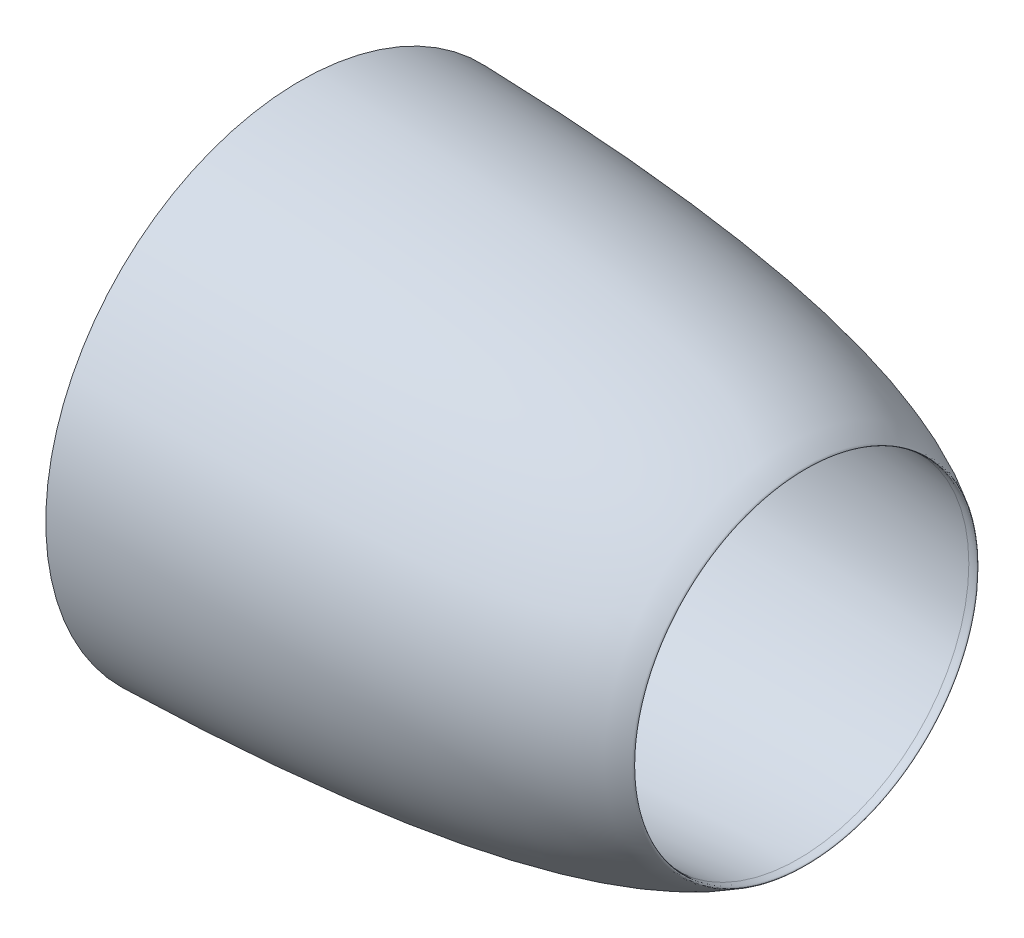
ISO-10303-21;
HEADER;
FILE_DESCRIPTION(('STEP AP214'),'2;1');
FILE_NAME('part.step','',(''),(''),'','','');
FILE_SCHEMA(('AUTOMOTIVE_DESIGN { 1 0 10303 214 1 1 1 1 }'));
ENDSEC;
DATA;
#1=APPLICATION_CONTEXT('core data for automotive mechanical design processes');
#2=APPLICATION_PROTOCOL_DEFINITION('international standard','automotive_design',2000,#1);
#3=PRODUCT_CONTEXT('',#1,'mechanical');
#4=PRODUCT('Part','Part','',(#3));
#5=PRODUCT_RELATED_PRODUCT_CATEGORY('part','',(#4));
#6=PRODUCT_DEFINITION_FORMATION('','',#4);
#7=PRODUCT_DEFINITION_CONTEXT('part definition',#1,'design');
#8=PRODUCT_DEFINITION('design','',#6,#7);
#9=PRODUCT_DEFINITION_SHAPE('','',#8);
#10=(LENGTH_UNIT() NAMED_UNIT(*) SI_UNIT(.MILLI.,.METRE.));
#11=(NAMED_UNIT(*) PLANE_ANGLE_UNIT() SI_UNIT($,.RADIAN.));
#12=(NAMED_UNIT(*) SI_UNIT($,.STERADIAN.) SOLID_ANGLE_UNIT());
#13=UNCERTAINTY_MEASURE_WITH_UNIT(LENGTH_MEASURE(1.E-05),#10,'distance_accuracy_value','');
#14=(GEOMETRIC_REPRESENTATION_CONTEXT(3) GLOBAL_UNCERTAINTY_ASSIGNED_CONTEXT((#13)) GLOBAL_UNIT_ASSIGNED_CONTEXT((#10,
#11,#12)) REPRESENTATION_CONTEXT('',''));
#15=CARTESIAN_POINT('',(0.,0.,0.));
#16=DIRECTION('',(0.,0.,1.));
#17=DIRECTION('',(1.,0.,0.));
#18=AXIS2_PLACEMENT_3D('',#15,#16,#17);
#19=CARTESIAN_POINT('',(-16.2695424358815,49.2273731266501,0.));
#20=CARTESIAN_POINT('',(57.7000408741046,47.5160802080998,0.));
#21=CARTESIAN_POINT('',(82.4369177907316,32.8053972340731,0.));
#22=CARTESIAN_POINT('',(80.,33.0009069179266,0.));
#23=B_SPLINE_CURVE_WITH_KNOTS('',2,(#19,#20,#21,#22),.UNSPECIFIED.,.F.,.F.,(3,1,3),(0.,
0.940488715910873,1.),.UNSPECIFIED.);
#24=CARTESIAN_POINT('',(113.006693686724,0.,0.));
#25=DIRECTION('',(1.,0.,0.));
#26=AXIS1_PLACEMENT('',#24,#25);
#27=SURFACE_OF_REVOLUTION('',#23,#26);
#28=CARTESIAN_POINT('',(80.,0.,0.));
#29=DIRECTION('',(1.,0.,0.));
#30=DIRECTION('',(0.,0.,-1.));
#31=AXIS2_PLACEMENT_3D('',#28,#29,#30);
#32=CIRCLE('',#31,33.0009069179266);
#33=CARTESIAN_POINT('',(80.,0.,-33.0009069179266));
#34=VERTEX_POINT('',#33);
#35=EDGE_CURVE('E44',#34,#34,#32,.T.);
#36=ORIENTED_EDGE('',*,*,#35,.F.);
#37=EDGE_LOOP('',(#36));
#38=FACE_BOUND('',#37,.T.);
#39=CARTESIAN_POINT('',(-16.2695424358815,0.,0.));
#40=DIRECTION('',(1.,0.,0.));
#41=DIRECTION('',(0.,0.,-1.));
#42=AXIS2_PLACEMENT_3D('',#39,#40,#41);
#43=CIRCLE('',#42,49.2273731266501);
#44=CARTESIAN_POINT('',(-16.2695424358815,0.,-49.2273731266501));
#45=VERTEX_POINT('',#44);
#46=EDGE_CURVE('E10',#45,#45,#43,.T.);
#47=ORIENTED_EDGE('',*,*,#46,.T.);
#48=EDGE_LOOP('',(#47));
#49=FACE_BOUND('',#48,.T.);
#50=ADVANCED_FACE('F33',(#38,#49),#27,.T.);
#51=CARTESIAN_POINT('',(1.96100421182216,0.,0.));
#52=DIRECTION('',(1.,0.,0.));
#53=DIRECTION('',(0.,0.,-1.));
#54=AXIS2_PLACEMENT_3D('',#51,#52,#53);
#55=TOROIDAL_SURFACE('',#54,62.4143807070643,22.5);
#56=ORIENTED_EDGE('',*,*,#46,.F.);
#57=EDGE_LOOP('',(#56));
#58=FACE_BOUND('',#57,.T.);
#59=CARTESIAN_POINT('',(0.,0.,0.));
#60=DIRECTION('',(1.,0.,0.));
#61=DIRECTION('',(0.,0.,-1.));
#62=AXIS2_PLACEMENT_3D('',#59,#60,#61);
#63=CIRCLE('',#62,40.);
#64=CARTESIAN_POINT('',(0.,0.,-40.));
#65=VERTEX_POINT('',#64);
#66=EDGE_CURVE('E40',#65,#65,#63,.T.);
#67=ORIENTED_EDGE('',*,*,#66,.T.);
#68=EDGE_LOOP('',(#67));
#69=FACE_BOUND('',#68,.T.);
#70=ADVANCED_FACE('F61',(#58,#69),#55,.T.);
#71=CARTESIAN_POINT('',(0.,0.,0.));
#72=DIRECTION('',(-1.,0.,0.));
#73=DIRECTION('',(0.,0.,1.));
#74=AXIS2_PLACEMENT_3D('',#71,#72,#73);
#75=CONICAL_SURFACE('',#74,40.,0.0872664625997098);
#76=ORIENTED_EDGE('',*,*,#35,.T.);
#77=EDGE_LOOP('',(#76));
#78=FACE_BOUND('',#77,.T.);
#79=ORIENTED_EDGE('',*,*,#66,.F.);
#80=EDGE_LOOP('',(#79));
#81=FACE_BOUND('',#80,.T.);
#82=ADVANCED_FACE('F57',(#78,#81),#75,.F.);
#83=CLOSED_SHELL('',(#50,#70,#82));
#84=MANIFOLD_SOLID_BREP('B2',#83);
#85=ADVANCED_BREP_SHAPE_REPRESENTATION('',(#18,#84),#14);
#86=SHAPE_DEFINITION_REPRESENTATION(#9,#85);
ENDSEC;
END-ISO-10303-21;
